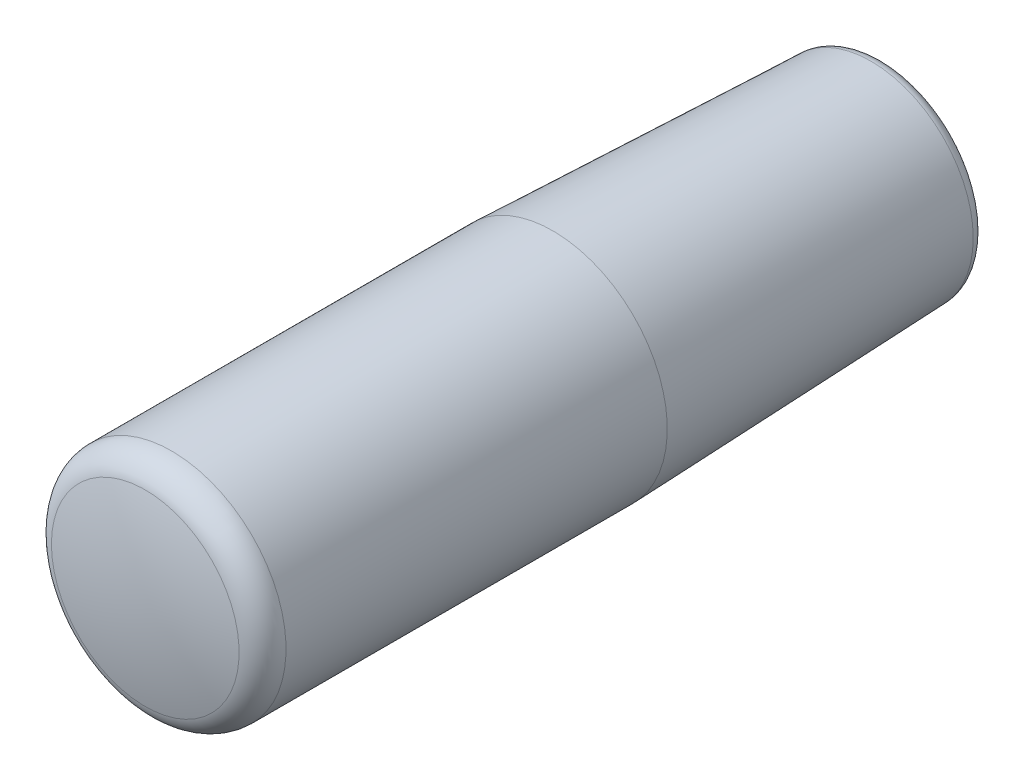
ISO-10303-21;
HEADER;
FILE_DESCRIPTION(('STEP AP214'),'2;1');
FILE_NAME('part.step','',(''),(''),'','','');
FILE_SCHEMA(('AUTOMOTIVE_DESIGN { 1 0 10303 214 1 1 1 1 }'));
ENDSEC;
DATA;
#1=APPLICATION_CONTEXT('core data for automotive mechanical design processes');
#2=APPLICATION_PROTOCOL_DEFINITION('international standard','automotive_design',2000,#1);
#3=PRODUCT_CONTEXT('',#1,'mechanical');
#4=PRODUCT('Part','Part','',(#3));
#5=PRODUCT_RELATED_PRODUCT_CATEGORY('part','',(#4));
#6=PRODUCT_DEFINITION_FORMATION('','',#4);
#7=PRODUCT_DEFINITION_CONTEXT('part definition',#1,'design');
#8=PRODUCT_DEFINITION('design','',#6,#7);
#9=PRODUCT_DEFINITION_SHAPE('','',#8);
#10=(LENGTH_UNIT() NAMED_UNIT(*) SI_UNIT(.MILLI.,.METRE.));
#11=(NAMED_UNIT(*) PLANE_ANGLE_UNIT() SI_UNIT($,.RADIAN.));
#12=(NAMED_UNIT(*) SI_UNIT($,.STERADIAN.) SOLID_ANGLE_UNIT());
#13=UNCERTAINTY_MEASURE_WITH_UNIT(LENGTH_MEASURE(1.E-05),#10,'distance_accuracy_value','');
#14=(GEOMETRIC_REPRESENTATION_CONTEXT(3) GLOBAL_UNCERTAINTY_ASSIGNED_CONTEXT((#13)) GLOBAL_UNIT_ASSIGNED_CONTEXT((#10,
#11,#12)) REPRESENTATION_CONTEXT('',''));
#15=CARTESIAN_POINT('',(0.,0.,0.));
#16=DIRECTION('',(0.,0.,1.));
#17=DIRECTION('',(1.,0.,0.));
#18=AXIS2_PLACEMENT_3D('',#15,#16,#17);
#19=CARTESIAN_POINT('',(0.,0.,1.));
#20=DIRECTION('',(0.,0.,-1.));
#21=DIRECTION('',(-1.,0.,0.));
#22=AXIS2_PLACEMENT_3D('',#19,#20,#21);
#23=TOROIDAL_SURFACE('',#22,7.03772216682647,1.);
#24=CARTESIAN_POINT('',(0.,0.,0.));
#25=DIRECTION('',(0.,0.,-1.));
#26=DIRECTION('',(-1.,0.,0.));
#27=AXIS2_PLACEMENT_3D('',#24,#25,#26);
#28=CIRCLE('',#27,7.03772216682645);
#29=CARTESIAN_POINT('',(-7.03772216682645,0.,0.));
#30=VERTEX_POINT('',#29);
#31=EDGE_CURVE('E8',#30,#30,#28,.T.);
#32=ORIENTED_EDGE('',*,*,#31,.F.);
#33=EDGE_LOOP('',(#32));
#34=FACE_BOUND('',#33,.T.);
#35=CARTESIAN_POINT('',(0.,0.,0.961566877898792));
#36=DIRECTION('',(0.,0.,-1.));
#37=DIRECTION('',(-1.,0.,0.));
#38=AXIS2_PLACEMENT_3D('',#35,#36,#37);
#39=CIRCLE('',#38,8.03698334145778);
#40=CARTESIAN_POINT('',(-8.03698334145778,0.,0.961566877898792));
#41=VERTEX_POINT('',#40);
#42=EDGE_CURVE('E34',#41,#41,#39,.T.);
#43=ORIENTED_EDGE('',*,*,#42,.T.);
#44=EDGE_LOOP('',(#43));
#45=FACE_BOUND('',#44,.T.);
#46=ADVANCED_FACE('F12',(#34,#45),#23,.T.);
#47=CARTESIAN_POINT('',(0.,7.03772216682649,0.));
#48=DIRECTION('',(0.,0.,1.));
#49=DIRECTION('',(1.,0.,0.));
#50=AXIS2_PLACEMENT_3D('',#47,#48,#49);
#51=PLANE('',#50);
#52=CARTESIAN_POINT('',(0.,0.,0.));
#53=DIRECTION('',(0.,0.,-1.));
#54=DIRECTION('',(-1.,0.,0.));
#55=AXIS2_PLACEMENT_3D('',#52,#53,#54);
#56=CIRCLE('',#55,4.);
#57=CARTESIAN_POINT('',(-4.,0.,0.));
#58=VERTEX_POINT('',#57);
#59=EDGE_CURVE('E18',#58,#58,#56,.T.);
#60=ORIENTED_EDGE('',*,*,#59,.F.);
#61=EDGE_LOOP('',(#60));
#62=FACE_BOUND('',#61,.T.);
#63=ORIENTED_EDGE('',*,*,#31,.T.);
#64=EDGE_LOOP('',(#63));
#65=FACE_BOUND('',#64,.T.);
#66=ADVANCED_FACE('F46',(#62,#65),#51,.F.);
#67=CARTESIAN_POINT('',(0.,0.,-2.5));
#68=DIRECTION('',(0.,0.,-1.));
#69=DIRECTION('',(-1.,0.,0.));
#70=AXIS2_PLACEMENT_3D('',#67,#68,#69);
#71=CYLINDRICAL_SURFACE('',#70,4.);
#72=CARTESIAN_POINT('',(0.,0.,12.));
#73=DIRECTION('',(0.,0.,-1.));
#74=DIRECTION('',(-1.,0.,0.));
#75=AXIS2_PLACEMENT_3D('',#72,#73,#74);
#76=CIRCLE('',#75,4.);
#77=CARTESIAN_POINT('',(-4.,0.,12.));
#78=VERTEX_POINT('',#77);
#79=EDGE_CURVE('E37',#78,#78,#76,.T.);
#80=ORIENTED_EDGE('',*,*,#79,.F.);
#81=EDGE_LOOP('',(#80));
#82=FACE_BOUND('',#81,.T.);
#83=ORIENTED_EDGE('',*,*,#59,.T.);
#84=EDGE_LOOP('',(#83));
#85=FACE_BOUND('',#84,.T.);
#86=ADVANCED_FACE('F43',(#82,#85),#71,.F.);
#87=CARTESIAN_POINT('',(0.,0.,29.));
#88=DIRECTION('',(-1.,0.,0.));
#89=DIRECTION('',(0.,0.,1.));
#90=AXIS2_PLACEMENT_3D('',#87,#88,#89);
#91=SPHERICAL_SURFACE('',#90,30.);
#92=CARTESIAN_POINT('',(0.,0.,29.));
#93=DIRECTION('',(0.,0.,-1.));
#94=DIRECTION('',(-1.,0.,0.));
#95=AXIS2_PLACEMENT_3D('',#92,#93,#94);
#96=SPHERICAL_SURFACE('',#95,30.);
#97=CARTESIAN_POINT('',(0.,0.,58.0769230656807));
#98=DIRECTION('',(0.,0.,-1.));
#99=DIRECTION('',(-1.,0.,0.));
#100=AXIS2_PLACEMENT_3D('',#97,#98,#99);
#101=CIRCLE('',#100,7.38461542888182);
#102=CARTESIAN_POINT('',(-7.38461542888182,0.,58.0769230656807));
#103=VERTEX_POINT('',#102);
#104=EDGE_CURVE('E22',#103,#103,#101,.T.);
#105=ORIENTED_EDGE('',*,*,#104,.F.);
#106=EDGE_LOOP('',(#105));
#107=FACE_BOUND('',#106,.T.);
#108=ADVANCED_FACE('F45',(#107),#96,.T.);
#109=CARTESIAN_POINT('',(0.,0.,56.));
#110=DIRECTION('',(0.,0.,-1.));
#111=DIRECTION('',(-1.,0.,0.));
#112=AXIS2_PLACEMENT_3D('',#109,#110,#111);
#113=TOROIDAL_SURFACE('',#112,6.8571428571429,2.14285714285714);
#114=CARTESIAN_POINT('',(0.,0.,56.));
#115=DIRECTION('',(0.,0.,-1.));
#116=DIRECTION('',(-1.,0.,0.));
#117=AXIS2_PLACEMENT_3D('',#114,#115,#116);
#118=CIRCLE('',#117,9.);
#119=CARTESIAN_POINT('',(-9.,0.,56.));
#120=VERTEX_POINT('',#119);
#121=EDGE_CURVE('E26',#120,#120,#118,.T.);
#122=ORIENTED_EDGE('',*,*,#121,.F.);
#123=EDGE_LOOP('',(#122));
#124=FACE_BOUND('',#123,.T.);
#125=ORIENTED_EDGE('',*,*,#104,.T.);
#126=EDGE_LOOP('',(#125));
#127=FACE_BOUND('',#126,.T.);
#128=ADVANCED_FACE('F53',(#124,#127),#113,.T.);
#129=CARTESIAN_POINT('',(0.,0.,-2.5));
#130=DIRECTION('',(0.,0.,-1.));
#131=DIRECTION('',(-1.,0.,0.));
#132=AXIS2_PLACEMENT_3D('',#129,#130,#131);
#133=CYLINDRICAL_SURFACE('',#132,9.);
#134=ORIENTED_EDGE('',*,*,#121,.T.);
#135=EDGE_LOOP('',(#134));
#136=FACE_BOUND('',#135,.T.);
#137=CARTESIAN_POINT('',(0.,0.,26.));
#138=DIRECTION('',(0.,0.,-1.));
#139=DIRECTION('',(-1.,0.,0.));
#140=AXIS2_PLACEMENT_3D('',#137,#138,#139);
#141=CIRCLE('',#140,9.);
#142=CARTESIAN_POINT('',(-9.,0.,26.));
#143=VERTEX_POINT('',#142);
#144=EDGE_CURVE('E31',#143,#143,#141,.T.);
#145=ORIENTED_EDGE('',*,*,#144,.F.);
#146=EDGE_LOOP('',(#145));
#147=FACE_BOUND('',#146,.T.);
#148=ADVANCED_FACE('F66',(#136,#147),#133,.T.);
#149=CARTESIAN_POINT('',(0.,0.,0.961566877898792));
#150=DIRECTION('',(0.,0.,1.));
#151=DIRECTION('',(1.,0.,0.));
#152=AXIS2_PLACEMENT_3D('',#149,#150,#151);
#153=CONICAL_SURFACE('',#152,8.03698334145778,0.0384425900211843);
#154=ORIENTED_EDGE('',*,*,#144,.T.);
#155=EDGE_LOOP('',(#154));
#156=FACE_BOUND('',#155,.T.);
#157=ORIENTED_EDGE('',*,*,#42,.F.);
#158=EDGE_LOOP('',(#157));
#159=FACE_BOUND('',#158,.T.);
#160=ADVANCED_FACE('F64',(#156,#159),#153,.T.);
#161=CARTESIAN_POINT('',(0.,0.,12.));
#162=DIRECTION('',(0.,0.,-1.));
#163=DIRECTION('',(-1.,0.,0.));
#164=AXIS2_PLACEMENT_3D('',#161,#162,#163);
#165=PLANE('',#164);
#166=ORIENTED_EDGE('',*,*,#79,.T.);
#167=EDGE_LOOP('',(#166));
#168=FACE_BOUND('',#167,.T.);
#169=ADVANCED_FACE('F41',(#168),#165,.T.);
#170=CLOSED_SHELL('',(#46,#66,#86,#108,#128,#148,#160,#169));
#171=MANIFOLD_SOLID_BREP('B1',#170);
#172=ADVANCED_BREP_SHAPE_REPRESENTATION('',(#18,#171),#14);
#173=SHAPE_DEFINITION_REPRESENTATION(#9,#172);
ENDSEC;
END-ISO-10303-21;
